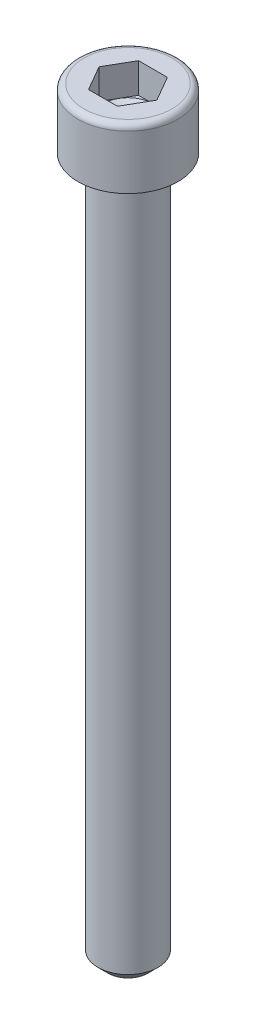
from build123d import *

# Parameters (mm, degrees)
ESQUISSE1_R             = 3
TIGE_DEPTH              = 70
CHANFREIN_D_ENTR_E_SIZE = 1
HEXAGONE_DEPTH          = 3


with BuildPart() as part:
    # Esquisse1 → Tige (new body)
    with BuildSketch(Plane(origin=(0, 0, 0), x_dir=(1, 0, 0), z_dir=(0, 1, 0))):
        with Locations(Location((0, 0, 0), (0, 0, 270))):
            Circle(ESQUISSE1_R)
    extrude(amount=-TIGE_DEPTH)

    # Chanfrein d_entr_e
    chanfrein_d_entr_e_edges = [part.edges().sort_by_distance(p)[0] for p in [
        (0, -70, -3),
    ]]
    chamfer(chanfrein_d_entr_e_edges, length=CHANFREIN_D_ENTR_E_SIZE)

    # Esquisse2 → T_te (revolve)
    with BuildSketch(Plane.XY, mode=Mode.PRIVATE) as t_te_sk:
        with BuildLine():
            Line((2.5, 6), (2.5, 3))
            Line((2.5, 3), (0, 1.556624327))
            Line((0, 1.556624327), (0, 0))
            Line((0, 0), (5, 0))
            Line((5, 0), (5, 5.4))
            ThreePointArc((5, 5.4), (4.824264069, 5.824264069), (4.4, 6))
            Line((4.4, 6), (2.5, 6))
        make_face()
    revolve(t_te_sk.sketch.rotate(Axis((0, 6, 0), (0, -1, 0)), 180), axis=Axis((0, 6, 0), (0, -1, 0)))

    # Esquisse3 → Hexagone (cut)
    with BuildSketch(Plane(origin=(0, 6, -3), x_dir=(1, 0, 0), z_dir=(0, -1, 0))):
        Polygon((1.443375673, 5.5), (-1.443375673, 5.5), (-2.886751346, 3), (-1.443375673, 0.5), (1.443375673, 0.5), (2.886751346, 3), align=None)
    extrude(amount=HEXAGONE_DEPTH, mode=Mode.SUBTRACT)


solid = part.part
